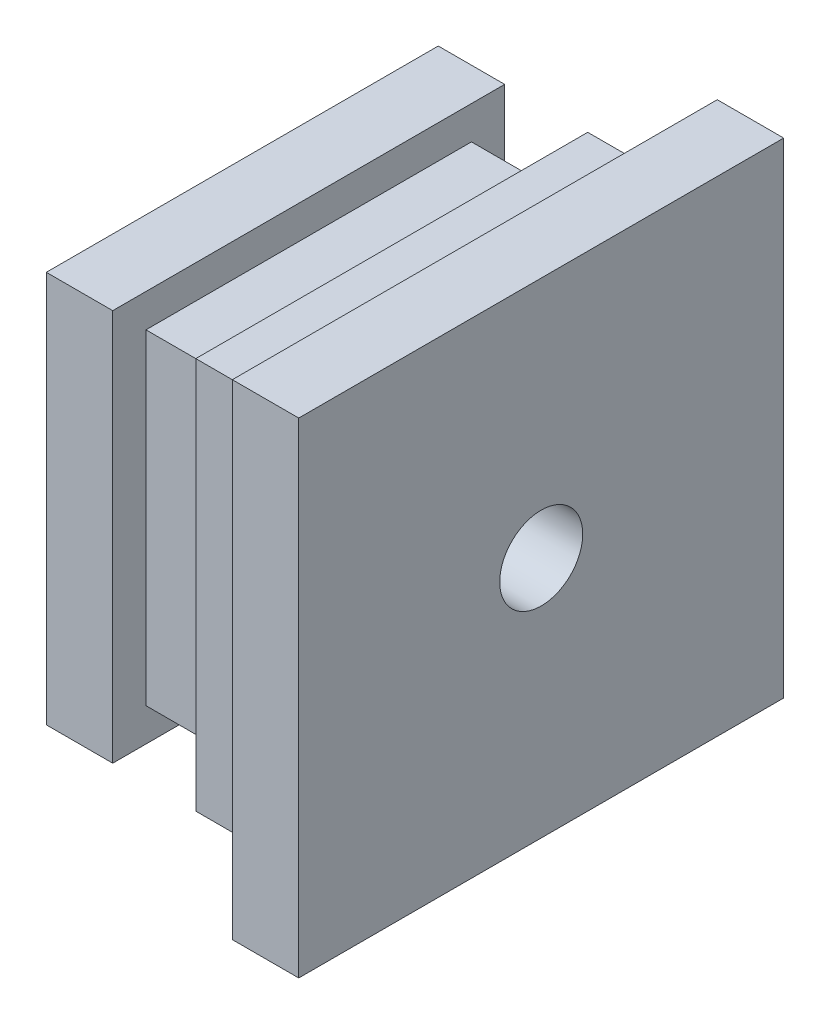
ISO-10303-21;
HEADER;
FILE_DESCRIPTION(('STEP AP214'),'2;1');
FILE_NAME('part.step','',(''),(''),'','','');
FILE_SCHEMA(('AUTOMOTIVE_DESIGN { 1 0 10303 214 1 1 1 1 }'));
ENDSEC;
DATA;
#1=APPLICATION_CONTEXT('core data for automotive mechanical design processes');
#2=APPLICATION_PROTOCOL_DEFINITION('international standard','automotive_design',2000,#1);
#3=PRODUCT_CONTEXT('',#1,'mechanical');
#4=PRODUCT('Part','Part','',(#3));
#5=PRODUCT_RELATED_PRODUCT_CATEGORY('part','',(#4));
#6=PRODUCT_DEFINITION_FORMATION('','',#4);
#7=PRODUCT_DEFINITION_CONTEXT('part definition',#1,'design');
#8=PRODUCT_DEFINITION('design','',#6,#7);
#9=PRODUCT_DEFINITION_SHAPE('','',#8);
#10=(LENGTH_UNIT() NAMED_UNIT(*) SI_UNIT(.MILLI.,.METRE.));
#11=(NAMED_UNIT(*) PLANE_ANGLE_UNIT() SI_UNIT($,.RADIAN.));
#12=(NAMED_UNIT(*) SI_UNIT($,.STERADIAN.) SOLID_ANGLE_UNIT());
#13=UNCERTAINTY_MEASURE_WITH_UNIT(LENGTH_MEASURE(1.E-05),#10,'distance_accuracy_value','');
#14=(GEOMETRIC_REPRESENTATION_CONTEXT(3) GLOBAL_UNCERTAINTY_ASSIGNED_CONTEXT((#13)) GLOBAL_UNIT_ASSIGNED_CONTEXT((#10,
#11,#12)) REPRESENTATION_CONTEXT('',''));
#15=CARTESIAN_POINT('',(0.,0.,0.));
#16=DIRECTION('',(0.,0.,1.));
#17=DIRECTION('',(1.,0.,0.));
#18=AXIS2_PLACEMENT_3D('',#15,#16,#17);
#19=CARTESIAN_POINT('',(10.,0.,-1.23858024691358));
#20=DIRECTION('',(0.,0.,1.));
#21=DIRECTION('',(1.,0.,0.));
#22=AXIS2_PLACEMENT_3D('',#19,#20,#21);
#23=PLANE('',#22);
#24=DIRECTION('',(0.,1.,0.));
#25=VECTOR('',#24,1.);
#26=CARTESIAN_POINT('',(8.,0.,-1.23858024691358));
#27=LINE('',#26,#25);
#28=CARTESIAN_POINT('',(8.,-8.51481481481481,-1.23858024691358));
#29=VERTEX_POINT('',#28);
#30=CARTESIAN_POINT('',(8.,6.08518518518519,-1.23858024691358));
#31=VERTEX_POINT('',#30);
#32=EDGE_CURVE('E114',#29,#31,#27,.T.);
#33=ORIENTED_EDGE('',*,*,#32,.T.);
#34=DIRECTION('',(-1.,0.,0.));
#35=VECTOR('',#34,1.);
#36=CARTESIAN_POINT('',(10.,6.08518518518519,-1.23858024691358));
#37=LINE('',#36,#35);
#38=CARTESIAN_POINT('',(10.,6.08518518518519,-1.23858024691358));
#39=VERTEX_POINT('',#38);
#40=EDGE_CURVE('E12',#39,#31,#37,.T.);
#41=ORIENTED_EDGE('',*,*,#40,.F.);
#42=DIRECTION('',(0.,1.,0.));
#43=VECTOR('',#42,1.);
#44=CARTESIAN_POINT('',(10.,0.,-1.23858024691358));
#45=LINE('',#44,#43);
#46=CARTESIAN_POINT('',(10.,-8.51481481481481,-1.23858024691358));
#47=VERTEX_POINT('',#46);
#48=EDGE_CURVE('E101',#47,#39,#45,.T.);
#49=ORIENTED_EDGE('',*,*,#48,.F.);
#50=DIRECTION('',(-1.,0.,0.));
#51=VECTOR('',#50,1.);
#52=CARTESIAN_POINT('',(10.,-8.51481481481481,-1.23858024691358));
#53=LINE('',#52,#51);
#54=EDGE_CURVE('E110',#47,#29,#53,.T.);
#55=ORIENTED_EDGE('',*,*,#54,.T.);
#56=EDGE_LOOP('',(#33,#41,#49,#55));
#57=FACE_BOUND('',#56,.T.);
#58=ADVANCED_FACE('F49',(#57),#23,.F.);
#59=CARTESIAN_POINT('',(10.,6.08518518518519,0.));
#60=DIRECTION('',(0.,-1.,0.));
#61=DIRECTION('',(0.,0.,-1.));
#62=AXIS2_PLACEMENT_3D('',#59,#60,#61);
#63=PLANE('',#62);
#64=DIRECTION('',(0.,0.,1.));
#65=VECTOR('',#64,1.);
#66=CARTESIAN_POINT('',(8.,6.08518518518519,0.));
#67=LINE('',#66,#65);
#68=CARTESIAN_POINT('',(8.,6.08518518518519,13.3614197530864));
#69=VERTEX_POINT('',#68);
#70=EDGE_CURVE('E105',#31,#69,#67,.T.);
#71=ORIENTED_EDGE('',*,*,#70,.T.);
#72=DIRECTION('',(-1.,0.,0.));
#73=VECTOR('',#72,1.);
#74=CARTESIAN_POINT('',(10.,6.08518518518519,13.3614197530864));
#75=LINE('',#74,#73);
#76=CARTESIAN_POINT('',(10.,6.08518518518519,13.3614197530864));
#77=VERTEX_POINT('',#76);
#78=EDGE_CURVE('E58',#77,#69,#75,.T.);
#79=ORIENTED_EDGE('',*,*,#78,.F.);
#80=DIRECTION('',(0.,0.,1.));
#81=VECTOR('',#80,1.);
#82=CARTESIAN_POINT('',(10.,6.08518518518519,0.));
#83=LINE('',#82,#81);
#84=EDGE_CURVE('E96',#39,#77,#83,.T.);
#85=ORIENTED_EDGE('',*,*,#84,.F.);
#86=ORIENTED_EDGE('',*,*,#40,.T.);
#87=EDGE_LOOP('',(#71,#79,#85,#86));
#88=FACE_BOUND('',#87,.T.);
#89=ADVANCED_FACE('F104',(#88),#63,.F.);
#90=CARTESIAN_POINT('',(10.,0.,13.3614197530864));
#91=DIRECTION('',(0.,0.,-1.));
#92=DIRECTION('',(0.,1.,0.));
#93=AXIS2_PLACEMENT_3D('',#90,#91,#92);
#94=PLANE('',#93);
#95=DIRECTION('',(0.,-1.,0.));
#96=VECTOR('',#95,1.);
#97=CARTESIAN_POINT('',(8.,0.,13.3614197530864));
#98=LINE('',#97,#96);
#99=CARTESIAN_POINT('',(8.,-8.51481481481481,13.3614197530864));
#100=VERTEX_POINT('',#99);
#101=EDGE_CURVE('E83',#69,#100,#98,.T.);
#102=ORIENTED_EDGE('',*,*,#101,.T.);
#103=DIRECTION('',(-1.,0.,0.));
#104=VECTOR('',#103,1.);
#105=CARTESIAN_POINT('',(10.,-8.51481481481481,13.3614197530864));
#106=LINE('',#105,#104);
#107=CARTESIAN_POINT('',(10.,-8.51481481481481,13.3614197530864));
#108=VERTEX_POINT('',#107);
#109=EDGE_CURVE('E106',#108,#100,#106,.T.);
#110=ORIENTED_EDGE('',*,*,#109,.F.);
#111=DIRECTION('',(0.,-1.,0.));
#112=VECTOR('',#111,1.);
#113=CARTESIAN_POINT('',(10.,0.,13.3614197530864));
#114=LINE('',#113,#112);
#115=EDGE_CURVE('E99',#77,#108,#114,.T.);
#116=ORIENTED_EDGE('',*,*,#115,.F.);
#117=ORIENTED_EDGE('',*,*,#78,.T.);
#118=EDGE_LOOP('',(#102,#110,#116,#117));
#119=FACE_BOUND('',#118,.T.);
#120=ADVANCED_FACE('F108',(#119),#94,.F.);
#121=CARTESIAN_POINT('',(10.,-8.51481481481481,0.));
#122=DIRECTION('',(0.,1.,0.));
#123=DIRECTION('',(0.,0.,1.));
#124=AXIS2_PLACEMENT_3D('',#121,#122,#123);
#125=PLANE('',#124);
#126=DIRECTION('',(0.,0.,-1.));
#127=VECTOR('',#126,1.);
#128=CARTESIAN_POINT('',(8.,-8.51481481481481,0.));
#129=LINE('',#128,#127);
#130=EDGE_CURVE('E89',#100,#29,#129,.T.);
#131=ORIENTED_EDGE('',*,*,#130,.T.);
#132=ORIENTED_EDGE('',*,*,#54,.F.);
#133=DIRECTION('',(0.,0.,-1.));
#134=VECTOR('',#133,1.);
#135=CARTESIAN_POINT('',(10.,-8.51481481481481,0.));
#136=LINE('',#135,#134);
#137=EDGE_CURVE('E66',#108,#47,#136,.T.);
#138=ORIENTED_EDGE('',*,*,#137,.F.);
#139=ORIENTED_EDGE('',*,*,#109,.T.);
#140=EDGE_LOOP('',(#131,#132,#138,#139));
#141=FACE_BOUND('',#140,.T.);
#142=ADVANCED_FACE('F121',(#141),#125,.F.);
#143=CARTESIAN_POINT('',(10.,0.,0.));
#144=DIRECTION('',(1.,0.,0.));
#145=DIRECTION('',(0.,0.,-1.));
#146=AXIS2_PLACEMENT_3D('',#143,#144,#145);
#147=PLANE('',#146);
#148=CARTESIAN_POINT('',(10.,-1.21481481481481,6.06141975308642));
#149=DIRECTION('',(1.,0.,0.));
#150=DIRECTION('',(0.,0.,-1.));
#151=AXIS2_PLACEMENT_3D('',#148,#149,#150);
#152=CIRCLE('',#151,1.25);
#153=CARTESIAN_POINT('',(10.,-1.21481481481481,4.81141975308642));
#154=VERTEX_POINT('',#153);
#155=EDGE_CURVE('E127',#154,#154,#152,.T.);
#156=ORIENTED_EDGE('',*,*,#155,.F.);
#157=EDGE_LOOP('',(#156));
#158=FACE_BOUND('',#157,.T.);
#159=ORIENTED_EDGE('',*,*,#48,.T.);
#160=ORIENTED_EDGE('',*,*,#84,.T.);
#161=ORIENTED_EDGE('',*,*,#115,.T.);
#162=ORIENTED_EDGE('',*,*,#137,.T.);
#163=EDGE_LOOP('',(#159,#160,#161,#162));
#164=FACE_BOUND('',#163,.T.);
#165=ADVANCED_FACE('F97',(#158,#164),#147,.T.);
#166=CARTESIAN_POINT('',(8.,0.,0.));
#167=DIRECTION('',(1.,0.,0.));
#168=DIRECTION('',(0.,0.,-1.));
#169=AXIS2_PLACEMENT_3D('',#166,#167,#168);
#170=PLANE('',#169);
#171=CARTESIAN_POINT('',(8.,-1.21481481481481,6.06141975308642));
#172=DIRECTION('',(1.,0.,0.));
#173=DIRECTION('',(0.,0.,-1.));
#174=AXIS2_PLACEMENT_3D('',#171,#172,#173);
#175=CIRCLE('',#174,1.25);
#176=CARTESIAN_POINT('',(8.,-1.21481481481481,4.81141975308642));
#177=VERTEX_POINT('',#176);
#178=EDGE_CURVE('E52',#177,#177,#175,.T.);
#179=ORIENTED_EDGE('',*,*,#178,.T.);
#180=EDGE_LOOP('',(#179));
#181=FACE_BOUND('',#180,.T.);
#182=ORIENTED_EDGE('',*,*,#32,.F.);
#183=ORIENTED_EDGE('',*,*,#130,.F.);
#184=ORIENTED_EDGE('',*,*,#101,.F.);
#185=ORIENTED_EDGE('',*,*,#70,.F.);
#186=EDGE_LOOP('',(#182,#183,#184,#185));
#187=FACE_BOUND('',#186,.T.);
#188=ADVANCED_FACE('F124',(#181,#187),#170,.F.);
#189=CARTESIAN_POINT('',(5.,-1.21481481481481,6.06141975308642));
#190=DIRECTION('',(1.,0.,0.));
#191=DIRECTION('',(0.,0.,-1.));
#192=AXIS2_PLACEMENT_3D('',#189,#190,#191);
#193=CYLINDRICAL_SURFACE('',#192,1.25);
#194=ORIENTED_EDGE('',*,*,#155,.T.);
#195=EDGE_LOOP('',(#194));
#196=FACE_BOUND('',#195,.T.);
#197=ORIENTED_EDGE('',*,*,#178,.F.);
#198=EDGE_LOOP('',(#197));
#199=FACE_BOUND('',#198,.T.);
#200=ADVANCED_FACE('F135',(#196,#199),#193,.F.);
#201=CLOSED_SHELL('',(#58,#89,#120,#142,#165,#188,#200));
#202=MANIFOLD_SOLID_BREP('B2',#201);
#203=CARTESIAN_POINT('',(8.,4.68518518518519,11.9614197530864));
#204=DIRECTION('',(0.,0.,-1.));
#205=DIRECTION('',(-1.,0.,0.));
#206=AXIS2_PLACEMENT_3D('',#203,#204,#205);
#207=PLANE('',#206);
#208=DIRECTION('',(-1.,0.,0.));
#209=VECTOR('',#208,1.);
#210=CARTESIAN_POINT('',(8.,4.68518518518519,11.9614197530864));
#211=LINE('',#210,#209);
#212=CARTESIAN_POINT('',(3.,4.68518518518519,11.9614197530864));
#213=VERTEX_POINT('',#212);
#214=CARTESIAN_POINT('',(1.,4.68518518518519,11.9614197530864));
#215=VERTEX_POINT('',#214);
#216=EDGE_CURVE('E377',#213,#215,#211,.T.);
#217=ORIENTED_EDGE('',*,*,#216,.T.);
#218=DIRECTION('',(0.,-1.,0.));
#219=VECTOR('',#218,1.);
#220=CARTESIAN_POINT('',(1.,4.68518518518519,11.9614197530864));
#221=LINE('',#220,#219);
#222=CARTESIAN_POINT('',(1.,-7.11481481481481,11.9614197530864));
#223=VERTEX_POINT('',#222);
#224=EDGE_CURVE('E402',#215,#223,#221,.T.);
#225=ORIENTED_EDGE('',*,*,#224,.T.);
#226=DIRECTION('',(-1.,0.,0.));
#227=VECTOR('',#226,1.);
#228=CARTESIAN_POINT('',(8.,-7.11481481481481,11.9614197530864));
#229=LINE('',#228,#227);
#230=CARTESIAN_POINT('',(3.,-7.11481481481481,11.9614197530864));
#231=VERTEX_POINT('',#230);
#232=EDGE_CURVE('E387',#231,#223,#229,.T.);
#233=ORIENTED_EDGE('',*,*,#232,.F.);
#234=DIRECTION('',(0.,1.,0.));
#235=VECTOR('',#234,1.);
#236=CARTESIAN_POINT('',(3.,0.,11.9614197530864));
#237=LINE('',#236,#235);
#238=EDGE_CURVE('E350',#231,#213,#237,.T.);
#239=ORIENTED_EDGE('',*,*,#238,.T.);
#240=EDGE_LOOP('',(#217,#225,#233,#239));
#241=FACE_BOUND('',#240,.T.);
#242=ADVANCED_FACE('F194',(#241),#207,.F.);
#243=CARTESIAN_POINT('',(8.,-7.11481481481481,11.9614197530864));
#244=DIRECTION('',(0.,1.,0.));
#245=DIRECTION('',(0.,0.,1.));
#246=AXIS2_PLACEMENT_3D('',#243,#244,#245);
#247=PLANE('',#246);
#248=ORIENTED_EDGE('',*,*,#232,.T.);
#249=DIRECTION('',(0.,0.,-1.));
#250=VECTOR('',#249,1.);
#251=CARTESIAN_POINT('',(1.,-7.11481481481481,11.9614197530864));
#252=LINE('',#251,#250);
#253=CARTESIAN_POINT('',(1.,-7.11481481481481,0.161419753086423));
#254=VERTEX_POINT('',#253);
#255=EDGE_CURVE('E390',#223,#254,#252,.T.);
#256=ORIENTED_EDGE('',*,*,#255,.T.);
#257=DIRECTION('',(-1.,0.,0.));
#258=VECTOR('',#257,1.);
#259=CARTESIAN_POINT('',(8.,-7.11481481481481,0.161419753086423));
#260=LINE('',#259,#258);
#261=CARTESIAN_POINT('',(3.,-7.11481481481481,0.161419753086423));
#262=VERTEX_POINT('',#261);
#263=EDGE_CURVE('E384',#262,#254,#260,.T.);
#264=ORIENTED_EDGE('',*,*,#263,.F.);
#265=DIRECTION('',(0.,0.,1.));
#266=VECTOR('',#265,1.);
#267=CARTESIAN_POINT('',(3.,-7.11481481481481,0.));
#268=LINE('',#267,#266);
#269=EDGE_CURVE('E347',#262,#231,#268,.T.);
#270=ORIENTED_EDGE('',*,*,#269,.T.);
#271=EDGE_LOOP('',(#248,#256,#264,#270));
#272=FACE_BOUND('',#271,.T.);
#273=ADVANCED_FACE('F485',(#272),#247,.F.);
#274=CARTESIAN_POINT('',(8.,4.68518518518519,0.161419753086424));
#275=DIRECTION('',(0.,0.,1.));
#276=DIRECTION('',(0.,-1.,0.));
#277=AXIS2_PLACEMENT_3D('',#274,#275,#276);
#278=PLANE('',#277);
#279=ORIENTED_EDGE('',*,*,#263,.T.);
#280=DIRECTION('',(0.,1.,0.));
#281=VECTOR('',#280,1.);
#282=CARTESIAN_POINT('',(1.,4.68518518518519,0.161419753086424));
#283=LINE('',#282,#281);
#284=CARTESIAN_POINT('',(1.,4.68518518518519,0.161419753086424));
#285=VERTEX_POINT('',#284);
#286=EDGE_CURVE('E404',#254,#285,#283,.T.);
#287=ORIENTED_EDGE('',*,*,#286,.T.);
#288=DIRECTION('',(-1.,0.,0.));
#289=VECTOR('',#288,1.);
#290=CARTESIAN_POINT('',(8.,4.68518518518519,0.161419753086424));
#291=LINE('',#290,#289);
#292=CARTESIAN_POINT('',(3.,4.68518518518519,0.161419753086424));
#293=VERTEX_POINT('',#292);
#294=EDGE_CURVE('E381',#293,#285,#291,.T.);
#295=ORIENTED_EDGE('',*,*,#294,.F.);
#296=DIRECTION('',(0.,-1.,0.));
#297=VECTOR('',#296,1.);
#298=CARTESIAN_POINT('',(3.,0.,0.161419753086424));
#299=LINE('',#298,#297);
#300=EDGE_CURVE('E344',#293,#262,#299,.T.);
#301=ORIENTED_EDGE('',*,*,#300,.T.);
#302=EDGE_LOOP('',(#279,#287,#295,#301));
#303=FACE_BOUND('',#302,.T.);
#304=ADVANCED_FACE('F491',(#303),#278,.F.);
#305=CARTESIAN_POINT('',(8.,4.68518518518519,11.9614197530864));
#306=DIRECTION('',(0.,-1.,0.));
#307=DIRECTION('',(0.,0.,-1.));
#308=AXIS2_PLACEMENT_3D('',#305,#306,#307);
#309=PLANE('',#308);
#310=ORIENTED_EDGE('',*,*,#294,.T.);
#311=DIRECTION('',(0.,0.,1.));
#312=VECTOR('',#311,1.);
#313=CARTESIAN_POINT('',(1.,4.68518518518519,11.9614197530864));
#314=LINE('',#313,#312);
#315=EDGE_CURVE('E406',#285,#215,#314,.T.);
#316=ORIENTED_EDGE('',*,*,#315,.T.);
#317=ORIENTED_EDGE('',*,*,#216,.F.);
#318=DIRECTION('',(0.,0.,-1.));
#319=VECTOR('',#318,1.);
#320=CARTESIAN_POINT('',(3.,4.68518518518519,0.));
#321=LINE('',#320,#319);
#322=EDGE_CURVE('E353',#213,#293,#321,.T.);
#323=ORIENTED_EDGE('',*,*,#322,.T.);
#324=EDGE_LOOP('',(#310,#316,#317,#323));
#325=FACE_BOUND('',#324,.T.);
#326=ADVANCED_FACE('F513',(#325),#309,.F.);
#327=CARTESIAN_POINT('',(0.,0.,0.));
#328=DIRECTION('',(1.,0.,0.));
#329=DIRECTION('',(0.,0.,-1.));
#330=AXIS2_PLACEMENT_3D('',#327,#328,#329);
#331=PLANE('',#330);
#332=DIRECTION('',(0.,-1.,0.));
#333=VECTOR('',#332,1.);
#334=CARTESIAN_POINT('',(0.,0.,1.16141975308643));
#335=LINE('',#334,#333);
#336=CARTESIAN_POINT('',(0.,3.68518518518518,1.16141975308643));
#337=VERTEX_POINT('',#336);
#338=CARTESIAN_POINT('',(0.,-6.11481481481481,1.16141975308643));
#339=VERTEX_POINT('',#338);
#340=EDGE_CURVE('E395',#337,#339,#335,.T.);
#341=ORIENTED_EDGE('',*,*,#340,.T.);
#342=DIRECTION('',(0.,0.,1.));
#343=VECTOR('',#342,1.);
#344=CARTESIAN_POINT('',(0.,-6.11481481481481,0.));
#345=LINE('',#344,#343);
#346=CARTESIAN_POINT('',(0.,-6.11481481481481,10.9614197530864));
#347=VERTEX_POINT('',#346);
#348=EDGE_CURVE('E399',#339,#347,#345,.T.);
#349=ORIENTED_EDGE('',*,*,#348,.T.);
#350=DIRECTION('',(0.,1.,0.));
#351=VECTOR('',#350,1.);
#352=CARTESIAN_POINT('',(0.,0.,10.9614197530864));
#353=LINE('',#352,#351);
#354=CARTESIAN_POINT('',(0.,3.68518518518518,10.9614197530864));
#355=VERTEX_POINT('',#354);
#356=EDGE_CURVE('E397',#347,#355,#353,.T.);
#357=ORIENTED_EDGE('',*,*,#356,.T.);
#358=DIRECTION('',(0.,0.,-1.));
#359=VECTOR('',#358,1.);
#360=CARTESIAN_POINT('',(0.,3.68518518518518,0.));
#361=LINE('',#360,#359);
#362=EDGE_CURVE('E393',#355,#337,#361,.T.);
#363=ORIENTED_EDGE('',*,*,#362,.T.);
#364=EDGE_LOOP('',(#341,#349,#357,#363));
#365=FACE_BOUND('',#364,.T.);
#366=ADVANCED_FACE('F517',(#365),#331,.F.);
#367=CARTESIAN_POINT('',(3.,-6.11481481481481,0.));
#368=DIRECTION('',(0.,1.,0.));
#369=DIRECTION('',(0.,0.,1.));
#370=AXIS2_PLACEMENT_3D('',#367,#368,#369);
#371=PLANE('',#370);
#372=DIRECTION('',(0.,0.,1.));
#373=VECTOR('',#372,1.);
#374=CARTESIAN_POINT('',(5.,-6.11481481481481,0.));
#375=LINE('',#374,#373);
#376=CARTESIAN_POINT('',(5.,-6.11481481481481,1.16141975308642));
#377=VERTEX_POINT('',#376);
#378=CARTESIAN_POINT('',(5.,-6.11481481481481,10.9614197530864));
#379=VERTEX_POINT('',#378);
#380=EDGE_CURVE('E356',#377,#379,#375,.T.);
#381=ORIENTED_EDGE('',*,*,#380,.T.);
#382=DIRECTION('',(1.,0.,0.));
#383=VECTOR('',#382,1.);
#384=CARTESIAN_POINT('',(3.,-6.11481481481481,10.9614197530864));
#385=LINE('',#384,#383);
#386=CARTESIAN_POINT('',(3.,-6.11481481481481,10.9614197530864));
#387=VERTEX_POINT('',#386);
#388=EDGE_CURVE('E328',#387,#379,#385,.T.);
#389=ORIENTED_EDGE('',*,*,#388,.F.);
#390=DIRECTION('',(0.,0.,1.));
#391=VECTOR('',#390,1.);
#392=CARTESIAN_POINT('',(3.,-6.11481481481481,0.));
#393=LINE('',#392,#391);
#394=CARTESIAN_POINT('',(3.,-6.11481481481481,1.16141975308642));
#395=VERTEX_POINT('',#394);
#396=EDGE_CURVE('E326',#395,#387,#393,.T.);
#397=ORIENTED_EDGE('',*,*,#396,.F.);
#398=DIRECTION('',(1.,0.,0.));
#399=VECTOR('',#398,1.);
#400=CARTESIAN_POINT('',(3.,-6.11481481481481,1.16141975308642));
#401=LINE('',#400,#399);
#402=EDGE_CURVE('E311',#395,#377,#401,.T.);
#403=ORIENTED_EDGE('',*,*,#402,.T.);
#404=EDGE_LOOP('',(#381,#389,#397,#403));
#405=FACE_BOUND('',#404,.T.);
#406=ADVANCED_FACE('F327',(#405),#371,.F.);
#407=CARTESIAN_POINT('',(3.,0.,1.16141975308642));
#408=DIRECTION('',(0.,0.,1.));
#409=DIRECTION('',(0.,-1.,0.));
#410=AXIS2_PLACEMENT_3D('',#407,#408,#409);
#411=PLANE('',#410);
#412=DIRECTION('',(0.,-1.,0.));
#413=VECTOR('',#412,1.);
#414=CARTESIAN_POINT('',(5.,0.,1.16141975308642));
#415=LINE('',#414,#413);
#416=CARTESIAN_POINT('',(5.,3.68518518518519,1.16141975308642));
#417=VERTEX_POINT('',#416);
#418=EDGE_CURVE('E318',#417,#377,#415,.T.);
#419=ORIENTED_EDGE('',*,*,#418,.T.);
#420=ORIENTED_EDGE('',*,*,#402,.F.);
#421=DIRECTION('',(0.,-1.,0.));
#422=VECTOR('',#421,1.);
#423=CARTESIAN_POINT('',(3.,0.,1.16141975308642));
#424=LINE('',#423,#422);
#425=CARTESIAN_POINT('',(3.,3.68518518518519,1.16141975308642));
#426=VERTEX_POINT('',#425);
#427=EDGE_CURVE('E315',#426,#395,#424,.T.);
#428=ORIENTED_EDGE('',*,*,#427,.F.);
#429=DIRECTION('',(1.,0.,0.));
#430=VECTOR('',#429,1.);
#431=CARTESIAN_POINT('',(3.,3.68518518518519,1.16141975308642));
#432=LINE('',#431,#430);
#433=EDGE_CURVE('E323',#426,#417,#432,.T.);
#434=ORIENTED_EDGE('',*,*,#433,.T.);
#435=EDGE_LOOP('',(#419,#420,#428,#434));
#436=FACE_BOUND('',#435,.T.);
#437=ADVANCED_FACE('F313',(#436),#411,.F.);
#438=CARTESIAN_POINT('',(3.,3.68518518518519,0.));
#439=DIRECTION('',(0.,-1.,0.));
#440=DIRECTION('',(0.,0.,-1.));
#441=AXIS2_PLACEMENT_3D('',#438,#439,#440);
#442=PLANE('',#441);
#443=DIRECTION('',(0.,0.,-1.));
#444=VECTOR('',#443,1.);
#445=CARTESIAN_POINT('',(5.,3.68518518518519,0.));
#446=LINE('',#445,#444);
#447=CARTESIAN_POINT('',(5.,3.68518518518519,10.9614197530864));
#448=VERTEX_POINT('',#447);
#449=EDGE_CURVE('E360',#448,#417,#446,.T.);
#450=ORIENTED_EDGE('',*,*,#449,.T.);
#451=ORIENTED_EDGE('',*,*,#433,.F.);
#452=DIRECTION('',(0.,0.,-1.));
#453=VECTOR('',#452,1.);
#454=CARTESIAN_POINT('',(3.,3.68518518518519,0.));
#455=LINE('',#454,#453);
#456=CARTESIAN_POINT('',(3.,3.68518518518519,10.9614197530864));
#457=VERTEX_POINT('',#456);
#458=EDGE_CURVE('E337',#457,#426,#455,.T.);
#459=ORIENTED_EDGE('',*,*,#458,.F.);
#460=DIRECTION('',(1.,0.,0.));
#461=VECTOR('',#460,1.);
#462=CARTESIAN_POINT('',(3.,3.68518518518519,10.9614197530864));
#463=LINE('',#462,#461);
#464=EDGE_CURVE('E366',#457,#448,#463,.T.);
#465=ORIENTED_EDGE('',*,*,#464,.T.);
#466=EDGE_LOOP('',(#450,#451,#459,#465));
#467=FACE_BOUND('',#466,.T.);
#468=ADVANCED_FACE('F475',(#467),#442,.F.);
#469=CARTESIAN_POINT('',(3.,0.,10.9614197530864));
#470=DIRECTION('',(0.,0.,-1.));
#471=DIRECTION('',(-1.,0.,0.));
#472=AXIS2_PLACEMENT_3D('',#469,#470,#471);
#473=PLANE('',#472);
#474=DIRECTION('',(0.,1.,0.));
#475=VECTOR('',#474,1.);
#476=CARTESIAN_POINT('',(5.,0.,10.9614197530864));
#477=LINE('',#476,#475);
#478=EDGE_CURVE('E332',#379,#448,#477,.T.);
#479=ORIENTED_EDGE('',*,*,#478,.T.);
#480=ORIENTED_EDGE('',*,*,#464,.F.);
#481=DIRECTION('',(0.,1.,0.));
#482=VECTOR('',#481,1.);
#483=CARTESIAN_POINT('',(3.,0.,10.9614197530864));
#484=LINE('',#483,#482);
#485=EDGE_CURVE('E339',#387,#457,#484,.T.);
#486=ORIENTED_EDGE('',*,*,#485,.F.);
#487=ORIENTED_EDGE('',*,*,#388,.T.);
#488=EDGE_LOOP('',(#479,#480,#486,#487));
#489=FACE_BOUND('',#488,.T.);
#490=ADVANCED_FACE('F473',(#489),#473,.F.);
#491=CARTESIAN_POINT('',(3.,0.,0.));
#492=DIRECTION('',(-1.,0.,0.));
#493=DIRECTION('',(0.,0.,1.));
#494=AXIS2_PLACEMENT_3D('',#491,#492,#493);
#495=PLANE('',#494);
#496=ORIENTED_EDGE('',*,*,#396,.T.);
#497=ORIENTED_EDGE('',*,*,#485,.T.);
#498=ORIENTED_EDGE('',*,*,#458,.T.);
#499=ORIENTED_EDGE('',*,*,#427,.T.);
#500=EDGE_LOOP('',(#496,#497,#498,#499));
#501=FACE_BOUND('',#500,.T.);
#502=ORIENTED_EDGE('',*,*,#300,.F.);
#503=ORIENTED_EDGE('',*,*,#322,.F.);
#504=ORIENTED_EDGE('',*,*,#238,.F.);
#505=ORIENTED_EDGE('',*,*,#269,.F.);
#506=EDGE_LOOP('',(#502,#503,#504,#505));
#507=FACE_BOUND('',#506,.T.);
#508=ADVANCED_FACE('F334',(#501,#507),#495,.F.);
#509=CARTESIAN_POINT('',(5.,0.,0.));
#510=DIRECTION('',(-1.,0.,0.));
#511=DIRECTION('',(0.,0.,1.));
#512=AXIS2_PLACEMENT_3D('',#509,#510,#511);
#513=PLANE('',#512);
#514=DIRECTION('',(0.,0.,1.));
#515=VECTOR('',#514,1.);
#516=CARTESIAN_POINT('',(5.,-6.61481481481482,11.9614197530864));
#517=LINE('',#516,#515);
#518=CARTESIAN_POINT('',(5.,-6.61481481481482,0.66141975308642));
#519=VERTEX_POINT('',#518);
#520=CARTESIAN_POINT('',(5.,-6.61481481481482,11.4614197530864));
#521=VERTEX_POINT('',#520);
#522=EDGE_CURVE('E422',#519,#521,#517,.T.);
#523=ORIENTED_EDGE('',*,*,#522,.T.);
#524=DIRECTION('',(0.,1.,0.));
#525=VECTOR('',#524,1.);
#526=CARTESIAN_POINT('',(5.,4.68518518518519,11.4614197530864));
#527=LINE('',#526,#525);
#528=CARTESIAN_POINT('',(5.,4.18518518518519,11.4614197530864));
#529=VERTEX_POINT('',#528);
#530=EDGE_CURVE('E424',#521,#529,#527,.T.);
#531=ORIENTED_EDGE('',*,*,#530,.T.);
#532=DIRECTION('',(0.,0.,-1.));
#533=VECTOR('',#532,1.);
#534=CARTESIAN_POINT('',(5.,4.18518518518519,0.161419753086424));
#535=LINE('',#534,#533);
#536=CARTESIAN_POINT('',(5.,4.18518518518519,0.661419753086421));
#537=VERTEX_POINT('',#536);
#538=EDGE_CURVE('E408',#529,#537,#535,.T.);
#539=ORIENTED_EDGE('',*,*,#538,.T.);
#540=DIRECTION('',(0.,-1.,0.));
#541=VECTOR('',#540,1.);
#542=CARTESIAN_POINT('',(5.,-7.11481481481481,0.66141975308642));
#543=LINE('',#542,#541);
#544=EDGE_CURVE('E420',#537,#519,#543,.T.);
#545=ORIENTED_EDGE('',*,*,#544,.T.);
#546=EDGE_LOOP('',(#523,#531,#539,#545));
#547=FACE_BOUND('',#546,.T.);
#548=ORIENTED_EDGE('',*,*,#380,.F.);
#549=ORIENTED_EDGE('',*,*,#418,.F.);
#550=ORIENTED_EDGE('',*,*,#449,.F.);
#551=ORIENTED_EDGE('',*,*,#478,.F.);
#552=EDGE_LOOP('',(#548,#549,#550,#551));
#553=FACE_BOUND('',#552,.T.);
#554=ADVANCED_FACE('F465',(#547,#553),#513,.T.);
#555=CARTESIAN_POINT('',(8.,0.,0.));
#556=DIRECTION('',(1.,0.,0.));
#557=DIRECTION('',(0.,0.,-1.));
#558=AXIS2_PLACEMENT_3D('',#555,#556,#557);
#559=PLANE('',#558);
#560=CARTESIAN_POINT('',(8.,-1.21481481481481,6.06141975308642));
#561=DIRECTION('',(1.,0.,0.));
#562=DIRECTION('',(0.,0.,-1.));
#563=AXIS2_PLACEMENT_3D('',#560,#561,#562);
#564=CIRCLE('',#563,1.25);
#565=CARTESIAN_POINT('',(8.,-1.21481481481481,4.81141975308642));
#566=VERTEX_POINT('',#565);
#567=EDGE_CURVE('E199',#566,#566,#564,.T.);
#568=ORIENTED_EDGE('',*,*,#567,.F.);
#569=EDGE_LOOP('',(#568));
#570=FACE_BOUND('',#569,.T.);
#571=DIRECTION('',(0.,-1.,0.));
#572=VECTOR('',#571,1.);
#573=CARTESIAN_POINT('',(8.,4.68518518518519,11.9614197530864));
#574=LINE('',#573,#572);
#575=CARTESIAN_POINT('',(8.,4.68518518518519,11.9614197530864));
#576=VERTEX_POINT('',#575);
#577=CARTESIAN_POINT('',(8.,-7.11481481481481,11.9614197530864));
#578=VERTEX_POINT('',#577);
#579=EDGE_CURVE('E322',#576,#578,#574,.T.);
#580=ORIENTED_EDGE('',*,*,#579,.T.);
#581=DIRECTION('',(0.,0.,-1.));
#582=VECTOR('',#581,1.);
#583=CARTESIAN_POINT('',(8.,-7.11481481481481,11.9614197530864));
#584=LINE('',#583,#582);
#585=CARTESIAN_POINT('',(8.,-7.11481481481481,0.161419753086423));
#586=VERTEX_POINT('',#585);
#587=EDGE_CURVE('E371',#578,#586,#584,.T.);
#588=ORIENTED_EDGE('',*,*,#587,.T.);
#589=DIRECTION('',(0.,1.,0.));
#590=VECTOR('',#589,1.);
#591=CARTESIAN_POINT('',(8.,4.68518518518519,0.161419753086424));
#592=LINE('',#591,#590);
#593=CARTESIAN_POINT('',(8.,4.68518518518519,0.161419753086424));
#594=VERTEX_POINT('',#593);
#595=EDGE_CURVE('E373',#586,#594,#592,.T.);
#596=ORIENTED_EDGE('',*,*,#595,.T.);
#597=DIRECTION('',(0.,0.,1.));
#598=VECTOR('',#597,1.);
#599=CARTESIAN_POINT('',(8.,4.68518518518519,11.9614197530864));
#600=LINE('',#599,#598);
#601=EDGE_CURVE('E375',#594,#576,#600,.T.);
#602=ORIENTED_EDGE('',*,*,#601,.T.);
#603=EDGE_LOOP('',(#580,#588,#596,#602));
#604=FACE_BOUND('',#603,.T.);
#605=ADVANCED_FACE('F468',(#570,#604),#559,.T.);
#606=CARTESIAN_POINT('',(5.5,4.68518518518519,0.161419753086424));
#607=VERTEX_POINT('',#606);
#608=EDGE_CURVE('E382',#594,#607,#291,.T.);
#609=ORIENTED_EDGE('',*,*,#608,.T.);
#610=DIRECTION('',(0.,0.,1.));
#611=VECTOR('',#610,1.);
#612=CARTESIAN_POINT('',(5.5,4.68518518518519,11.9614197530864));
#613=LINE('',#612,#611);
#614=CARTESIAN_POINT('',(5.5,4.68518518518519,11.9614197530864));
#615=VERTEX_POINT('',#614);
#616=EDGE_CURVE('E47',#607,#615,#613,.T.);
#617=ORIENTED_EDGE('',*,*,#616,.T.);
#618=EDGE_CURVE('E378',#576,#615,#211,.T.);
#619=ORIENTED_EDGE('',*,*,#618,.F.);
#620=ORIENTED_EDGE('',*,*,#601,.F.);
#621=EDGE_LOOP('',(#609,#617,#619,#620));
#622=FACE_BOUND('',#621,.T.);
#623=ADVANCED_FACE('F454',(#622),#309,.F.);
#624=CARTESIAN_POINT('',(5.5,-7.11481481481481,0.161419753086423));
#625=VERTEX_POINT('',#624);
#626=EDGE_CURVE('E385',#586,#625,#260,.T.);
#627=ORIENTED_EDGE('',*,*,#626,.T.);
#628=DIRECTION('',(0.,1.,0.));
#629=VECTOR('',#628,1.);
#630=CARTESIAN_POINT('',(5.5,4.68518518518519,0.161419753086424));
#631=LINE('',#630,#629);
#632=EDGE_CURVE('E204',#625,#607,#631,.T.);
#633=ORIENTED_EDGE('',*,*,#632,.T.);
#634=ORIENTED_EDGE('',*,*,#608,.F.);
#635=ORIENTED_EDGE('',*,*,#595,.F.);
#636=EDGE_LOOP('',(#627,#633,#634,#635));
#637=FACE_BOUND('',#636,.T.);
#638=ADVANCED_FACE('F506',(#637),#278,.F.);
#639=CARTESIAN_POINT('',(5.5,-7.11481481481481,11.9614197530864));
#640=VERTEX_POINT('',#639);
#641=EDGE_CURVE('E388',#578,#640,#229,.T.);
#642=ORIENTED_EDGE('',*,*,#641,.T.);
#643=DIRECTION('',(0.,0.,-1.));
#644=VECTOR('',#643,1.);
#645=CARTESIAN_POINT('',(5.5,-7.11481481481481,0.161419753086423));
#646=LINE('',#645,#644);
#647=EDGE_CURVE('E219',#640,#625,#646,.T.);
#648=ORIENTED_EDGE('',*,*,#647,.T.);
#649=ORIENTED_EDGE('',*,*,#626,.F.);
#650=ORIENTED_EDGE('',*,*,#587,.F.);
#651=EDGE_LOOP('',(#642,#648,#649,#650));
#652=FACE_BOUND('',#651,.T.);
#653=ADVANCED_FACE('F494',(#652),#247,.F.);
#654=ORIENTED_EDGE('',*,*,#618,.T.);
#655=DIRECTION('',(0.,-1.,0.));
#656=VECTOR('',#655,1.);
#657=CARTESIAN_POINT('',(5.5,-7.11481481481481,11.9614197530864));
#658=LINE('',#657,#656);
#659=EDGE_CURVE('E427',#615,#640,#658,.T.);
#660=ORIENTED_EDGE('',*,*,#659,.T.);
#661=ORIENTED_EDGE('',*,*,#641,.F.);
#662=ORIENTED_EDGE('',*,*,#579,.F.);
#663=EDGE_LOOP('',(#654,#660,#661,#662));
#664=FACE_BOUND('',#663,.T.);
#665=ADVANCED_FACE('F459',(#664),#207,.F.);
#666=CARTESIAN_POINT('',(1.,4.68518518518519,11.9614197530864));
#667=DIRECTION('',(0.707106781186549,-0.707106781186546,0.));
#668=DIRECTION('',(0.,0.,1.));
#669=AXIS2_PLACEMENT_3D('',#666,#667,#668);
#670=PLANE('',#669);
#671=DIRECTION('',(-0.577350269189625,-0.577350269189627,0.577350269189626));
#672=VECTOR('',#671,1.);
#673=CARTESIAN_POINT('',(-2.93333333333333,0.751851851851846,4.09475308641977));
#674=LINE('',#673,#672);
#675=EDGE_CURVE('E414',#337,#285,#674,.F.);
#676=ORIENTED_EDGE('',*,*,#675,.F.);
#677=ORIENTED_EDGE('',*,*,#362,.F.);
#678=DIRECTION('',(0.577350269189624,0.577350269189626,0.577350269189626));
#679=VECTOR('',#678,1.);
#680=CARTESIAN_POINT('',(1.,4.68518518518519,11.9614197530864));
#681=LINE('',#680,#679);
#682=EDGE_CURVE('E358',#215,#355,#681,.F.);
#683=ORIENTED_EDGE('',*,*,#682,.F.);
#684=ORIENTED_EDGE('',*,*,#315,.F.);
#685=EDGE_LOOP('',(#676,#677,#683,#684));
#686=FACE_BOUND('',#685,.T.);
#687=ADVANCED_FACE('F498',(#686),#670,.F.);
#688=CARTESIAN_POINT('',(1.,4.68518518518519,11.9614197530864));
#689=DIRECTION('',(0.707106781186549,0.,-0.707106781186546));
#690=DIRECTION('',(0.,-1.,0.));
#691=AXIS2_PLACEMENT_3D('',#688,#689,#690);
#692=PLANE('',#691);
#693=ORIENTED_EDGE('',*,*,#682,.T.);
#694=ORIENTED_EDGE('',*,*,#356,.F.);
#695=DIRECTION('',(0.577350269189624,-0.577350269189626,0.577350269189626));
#696=VECTOR('',#695,1.);
#697=CARTESIAN_POINT('',(-2.93333333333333,-3.18148148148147,8.02808641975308));
#698=LINE('',#697,#696);
#699=EDGE_CURVE('E411',#223,#347,#698,.F.);
#700=ORIENTED_EDGE('',*,*,#699,.F.);
#701=ORIENTED_EDGE('',*,*,#224,.F.);
#702=EDGE_LOOP('',(#693,#694,#700,#701));
#703=FACE_BOUND('',#702,.T.);
#704=ADVANCED_FACE('F503',(#703),#692,.F.);
#705=CARTESIAN_POINT('',(1.,4.68518518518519,0.161419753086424));
#706=DIRECTION('',(0.707106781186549,0.,0.707106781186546));
#707=DIRECTION('',(0.,1.,0.));
#708=AXIS2_PLACEMENT_3D('',#705,#706,#707);
#709=PLANE('',#708);
#710=ORIENTED_EDGE('',*,*,#675,.T.);
#711=ORIENTED_EDGE('',*,*,#286,.F.);
#712=DIRECTION('',(-0.577350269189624,0.577350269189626,0.577350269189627));
#713=VECTOR('',#712,1.);
#714=CARTESIAN_POINT('',(-2.93333333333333,-3.18148148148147,4.09475308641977));
#715=LINE('',#714,#713);
#716=EDGE_CURVE('E409',#339,#254,#715,.F.);
#717=ORIENTED_EDGE('',*,*,#716,.F.);
#718=ORIENTED_EDGE('',*,*,#340,.F.);
#719=EDGE_LOOP('',(#710,#711,#717,#718));
#720=FACE_BOUND('',#719,.T.);
#721=ADVANCED_FACE('F596',(#720),#709,.F.);
#722=CARTESIAN_POINT('',(1.,-7.11481481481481,11.9614197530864));
#723=DIRECTION('',(0.707106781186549,0.707106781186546,0.));
#724=DIRECTION('',(0.,0.,-1.));
#725=AXIS2_PLACEMENT_3D('',#722,#723,#724);
#726=PLANE('',#725);
#727=ORIENTED_EDGE('',*,*,#699,.T.);
#728=ORIENTED_EDGE('',*,*,#348,.F.);
#729=ORIENTED_EDGE('',*,*,#716,.T.);
#730=ORIENTED_EDGE('',*,*,#255,.F.);
#731=EDGE_LOOP('',(#727,#728,#729,#730));
#732=FACE_BOUND('',#731,.T.);
#733=ADVANCED_FACE('F606',(#732),#726,.F.);
#734=CARTESIAN_POINT('',(5.,0.,0.661419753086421));
#735=DIRECTION('',(-0.707106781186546,0.,-0.707106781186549));
#736=DIRECTION('',(0.,1.,0.));
#737=AXIS2_PLACEMENT_3D('',#734,#735,#736);
#738=PLANE('',#737);
#739=DIRECTION('',(-0.577350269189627,-0.577350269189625,0.577350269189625));
#740=VECTOR('',#739,1.);
#741=CARTESIAN_POINT('',(5.22047325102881,4.405658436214,0.440946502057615));
#742=LINE('',#741,#740);
#743=EDGE_CURVE('E436',#607,#537,#742,.T.);
#744=ORIENTED_EDGE('',*,*,#743,.F.);
#745=ORIENTED_EDGE('',*,*,#632,.F.);
#746=DIRECTION('',(-0.577350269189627,0.577350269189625,0.577350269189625));
#747=VECTOR('',#746,1.);
#748=CARTESIAN_POINT('',(2.79506172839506,-4.40987654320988,2.86635802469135));
#749=LINE('',#748,#747);
#750=EDGE_CURVE('E412',#519,#625,#749,.F.);
#751=ORIENTED_EDGE('',*,*,#750,.F.);
#752=ORIENTED_EDGE('',*,*,#544,.F.);
#753=EDGE_LOOP('',(#744,#745,#751,#752));
#754=FACE_BOUND('',#753,.T.);
#755=ADVANCED_FACE('F197',(#754),#738,.T.);
#756=CARTESIAN_POINT('',(5.,-6.61481481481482,0.));
#757=DIRECTION('',(-0.707106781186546,-0.707106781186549,0.));
#758=DIRECTION('',(0.,0.,-1.));
#759=AXIS2_PLACEMENT_3D('',#756,#757,#758);
#760=PLANE('',#759);
#761=ORIENTED_EDGE('',*,*,#750,.T.);
#762=ORIENTED_EDGE('',*,*,#647,.F.);
#763=DIRECTION('',(-0.577350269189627,0.577350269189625,-0.577350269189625));
#764=VECTOR('',#763,1.);
#765=CARTESIAN_POINT('',(1.17952674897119,-2.79434156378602,7.64094650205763));
#766=LINE('',#765,#764);
#767=EDGE_CURVE('E434',#521,#640,#766,.F.);
#768=ORIENTED_EDGE('',*,*,#767,.F.);
#769=ORIENTED_EDGE('',*,*,#522,.F.);
#770=EDGE_LOOP('',(#761,#762,#768,#769));
#771=FACE_BOUND('',#770,.T.);
#772=ADVANCED_FACE('F442',(#771),#760,.T.);
#773=CARTESIAN_POINT('',(5.,4.18518518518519,0.));
#774=DIRECTION('',(-0.707106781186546,0.707106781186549,0.));
#775=DIRECTION('',(0.,0.,1.));
#776=AXIS2_PLACEMENT_3D('',#773,#774,#775);
#777=PLANE('',#776);
#778=ORIENTED_EDGE('',*,*,#743,.T.);
#779=ORIENTED_EDGE('',*,*,#538,.F.);
#780=DIRECTION('',(0.577350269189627,0.577350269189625,0.577350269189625));
#781=VECTOR('',#780,1.);
#782=CARTESIAN_POINT('',(1.17952674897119,0.364711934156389,7.64094650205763));
#783=LINE('',#782,#781);
#784=EDGE_CURVE('E432',#615,#529,#783,.F.);
#785=ORIENTED_EDGE('',*,*,#784,.F.);
#786=ORIENTED_EDGE('',*,*,#616,.F.);
#787=EDGE_LOOP('',(#778,#779,#785,#786));
#788=FACE_BOUND('',#787,.T.);
#789=ADVANCED_FACE('F451',(#788),#777,.T.);
#790=CARTESIAN_POINT('',(5.,0.,11.4614197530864));
#791=DIRECTION('',(-0.707106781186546,0.,0.707106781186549));
#792=DIRECTION('',(0.,-1.,0.));
#793=AXIS2_PLACEMENT_3D('',#790,#791,#792);
#794=PLANE('',#793);
#795=ORIENTED_EDGE('',*,*,#767,.T.);
#796=ORIENTED_EDGE('',*,*,#659,.F.);
#797=ORIENTED_EDGE('',*,*,#784,.T.);
#798=ORIENTED_EDGE('',*,*,#530,.F.);
#799=EDGE_LOOP('',(#795,#796,#797,#798));
#800=FACE_BOUND('',#799,.T.);
#801=ADVANCED_FACE('F462',(#800),#794,.T.);
#802=CARTESIAN_POINT('',(5.,-1.21481481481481,6.06141975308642));
#803=DIRECTION('',(1.,0.,0.));
#804=DIRECTION('',(0.,0.,-1.));
#805=AXIS2_PLACEMENT_3D('',#802,#803,#804);
#806=CYLINDRICAL_SURFACE('',#805,1.25);
#807=ORIENTED_EDGE('',*,*,#567,.T.);
#808=EDGE_LOOP('',(#807));
#809=FACE_BOUND('',#808,.T.);
#810=CARTESIAN_POINT('',(5.,-1.21481481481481,6.06141975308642));
#811=DIRECTION('',(1.,0.,0.));
#812=DIRECTION('',(0.,0.,-1.));
#813=AXIS2_PLACEMENT_3D('',#810,#811,#812);
#814=CIRCLE('',#813,1.25);
#815=CARTESIAN_POINT('',(5.,-1.21481481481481,4.81141975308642));
#816=VERTEX_POINT('',#815);
#817=EDGE_CURVE('E701',#816,#816,#814,.T.);
#818=ORIENTED_EDGE('',*,*,#817,.F.);
#819=EDGE_LOOP('',(#818));
#820=FACE_BOUND('',#819,.T.);
#821=ADVANCED_FACE('F671',(#809,#820),#806,.F.);
#822=CARTESIAN_POINT('',(5.,0.,0.));
#823=DIRECTION('',(1.,0.,0.));
#824=DIRECTION('',(0.,0.,-1.));
#825=AXIS2_PLACEMENT_3D('',#822,#823,#824);
#826=PLANE('',#825);
#827=ORIENTED_EDGE('',*,*,#817,.T.);
#828=EDGE_LOOP('',(#827));
#829=FACE_BOUND('',#828,.T.);
#830=ADVANCED_FACE('F685',(#829),#826,.T.);
#831=CLOSED_SHELL('',(#242,#273,#304,#326,#366,#406,#437,#468,#490,#508,#554,#605,#623,#638,
#653,#665,#687,#704,#721,#733,#755,#772,#789,#801,#821,#830));
#832=MANIFOLD_SOLID_BREP('B6',#831);
#833=ADVANCED_BREP_SHAPE_REPRESENTATION('',(#18,#202,#832),#14);
#834=SHAPE_DEFINITION_REPRESENTATION(#9,#833);
ENDSEC;
END-ISO-10303-21;
